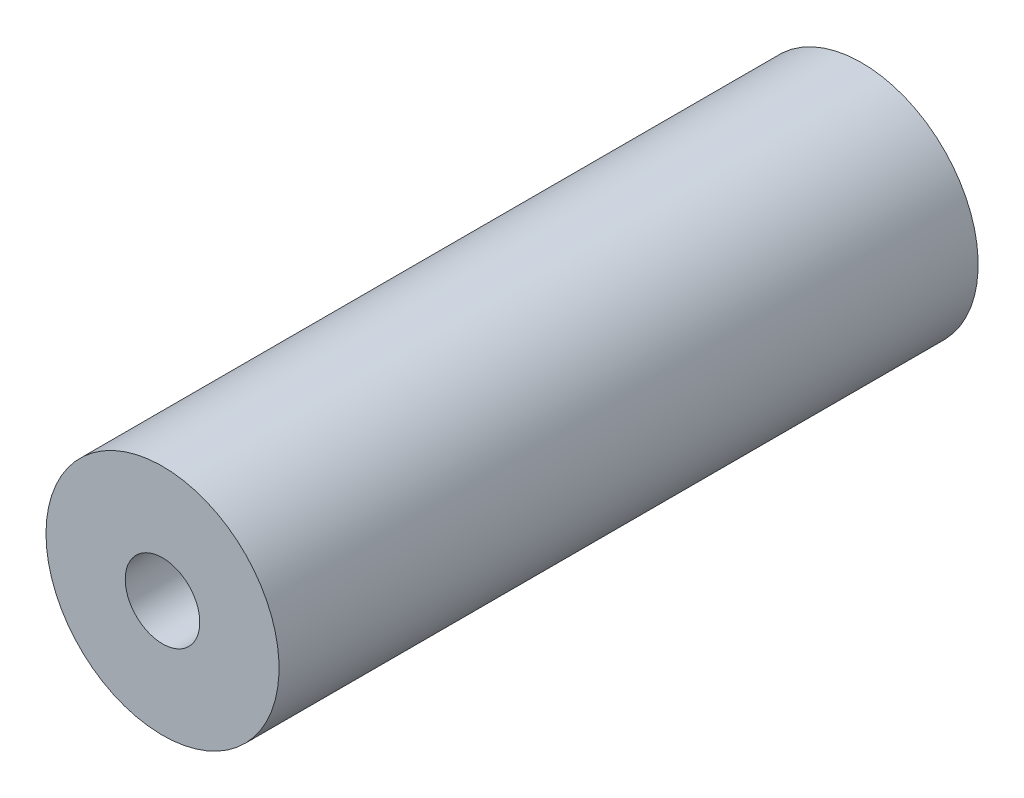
ISO-10303-21;
HEADER;
FILE_DESCRIPTION(('STEP AP214'),'2;1');
FILE_NAME('part.step','',(''),(''),'','','');
FILE_SCHEMA(('AUTOMOTIVE_DESIGN { 1 0 10303 214 1 1 1 1 }'));
ENDSEC;
DATA;
#1=APPLICATION_CONTEXT('core data for automotive mechanical design processes');
#2=APPLICATION_PROTOCOL_DEFINITION('international standard','automotive_design',2000,#1);
#3=PRODUCT_CONTEXT('',#1,'mechanical');
#4=PRODUCT('Part','Part','',(#3));
#5=PRODUCT_RELATED_PRODUCT_CATEGORY('part','',(#4));
#6=PRODUCT_DEFINITION_FORMATION('','',#4);
#7=PRODUCT_DEFINITION_CONTEXT('part definition',#1,'design');
#8=PRODUCT_DEFINITION('design','',#6,#7);
#9=PRODUCT_DEFINITION_SHAPE('','',#8);
#10=(LENGTH_UNIT() NAMED_UNIT(*) SI_UNIT(.MILLI.,.METRE.));
#11=(NAMED_UNIT(*) PLANE_ANGLE_UNIT() SI_UNIT($,.RADIAN.));
#12=(NAMED_UNIT(*) SI_UNIT($,.STERADIAN.) SOLID_ANGLE_UNIT());
#13=UNCERTAINTY_MEASURE_WITH_UNIT(LENGTH_MEASURE(1.E-05),#10,'distance_accuracy_value','');
#14=(GEOMETRIC_REPRESENTATION_CONTEXT(3) GLOBAL_UNCERTAINTY_ASSIGNED_CONTEXT((#13)) GLOBAL_UNIT_ASSIGNED_CONTEXT((#10,
#11,#12)) REPRESENTATION_CONTEXT('',''));
#15=CARTESIAN_POINT('',(0.,0.,0.));
#16=DIRECTION('',(0.,0.,1.));
#17=DIRECTION('',(1.,0.,0.));
#18=AXIS2_PLACEMENT_3D('',#15,#16,#17);
#19=CARTESIAN_POINT('',(0.,0.,19.05));
#20=DIRECTION('',(0.,0.,1.));
#21=DIRECTION('',(1.,0.,0.));
#22=AXIS2_PLACEMENT_3D('',#19,#20,#21);
#23=PLANE('',#22);
#24=CARTESIAN_POINT('',(0.,0.,19.05));
#25=DIRECTION('',(0.,0.,1.));
#26=DIRECTION('',(1.,0.,0.));
#27=AXIS2_PLACEMENT_3D('',#24,#25,#26);
#28=CIRCLE('',#27,3.175);
#29=CARTESIAN_POINT('',(-3.175,0.,19.05));
#30=VERTEX_POINT('',#29);
#31=EDGE_CURVE('E10',#30,#30,#28,.T.);
#32=ORIENTED_EDGE('',*,*,#31,.T.);
#33=EDGE_LOOP('',(#32));
#34=FACE_BOUND('',#33,.T.);
#35=CARTESIAN_POINT('',(0.,0.,19.05));
#36=DIRECTION('',(0.,0.,1.));
#37=DIRECTION('',(1.,0.,0.));
#38=AXIS2_PLACEMENT_3D('',#35,#36,#37);
#39=CIRCLE('',#38,1.016);
#40=CARTESIAN_POINT('',(-1.016,0.,19.05));
#41=VERTEX_POINT('',#40);
#42=EDGE_CURVE('E42',#41,#41,#39,.T.);
#43=ORIENTED_EDGE('',*,*,#42,.F.);
#44=EDGE_LOOP('',(#43));
#45=FACE_BOUND('',#44,.T.);
#46=ADVANCED_FACE('F31',(#34,#45),#23,.T.);
#47=CARTESIAN_POINT('',(0.,0.,0.));
#48=DIRECTION('',(0.,0.,1.));
#49=DIRECTION('',(1.,0.,0.));
#50=AXIS2_PLACEMENT_3D('',#47,#48,#49);
#51=PLANE('',#50);
#52=CARTESIAN_POINT('',(0.,0.,0.));
#53=DIRECTION('',(0.,0.,1.));
#54=DIRECTION('',(1.,0.,0.));
#55=AXIS2_PLACEMENT_3D('',#52,#53,#54);
#56=CIRCLE('',#55,3.175);
#57=CARTESIAN_POINT('',(-3.175,0.,0.));
#58=VERTEX_POINT('',#57);
#59=EDGE_CURVE('E35',#58,#58,#56,.T.);
#60=ORIENTED_EDGE('',*,*,#59,.F.);
#61=EDGE_LOOP('',(#60));
#62=FACE_BOUND('',#61,.T.);
#63=CARTESIAN_POINT('',(0.,0.,0.));
#64=DIRECTION('',(0.,0.,1.));
#65=DIRECTION('',(1.,0.,0.));
#66=AXIS2_PLACEMENT_3D('',#63,#64,#65);
#67=CIRCLE('',#66,1.016);
#68=CARTESIAN_POINT('',(-1.016,0.,0.));
#69=VERTEX_POINT('',#68);
#70=EDGE_CURVE('E44',#69,#69,#67,.T.);
#71=ORIENTED_EDGE('',*,*,#70,.T.);
#72=EDGE_LOOP('',(#71));
#73=FACE_BOUND('',#72,.T.);
#74=ADVANCED_FACE('F54',(#62,#73),#51,.F.);
#75=CARTESIAN_POINT('',(0.,0.,19.05));
#76=DIRECTION('',(0.,0.,-1.));
#77=DIRECTION('',(-1.,0.,0.));
#78=AXIS2_PLACEMENT_3D('',#75,#76,#77);
#79=CYLINDRICAL_SURFACE('',#78,3.175);
#80=CARTESIAN_POINT('',(-3.175,0.,19.05));
#81=CARTESIAN_POINT('',(-3.175,0.,18.8515625));
#82=CARTESIAN_POINT('',(-3.175,0.,18.653125));
#83=CARTESIAN_POINT('',(-3.175,0.,18.25625));
#84=CARTESIAN_POINT('',(-3.175,0.,18.0578125));
#85=CARTESIAN_POINT('',(-3.175,0.,17.6609375));
#86=CARTESIAN_POINT('',(-3.175,0.,17.4625));
#87=CARTESIAN_POINT('',(-3.175,0.,17.065625));
#88=CARTESIAN_POINT('',(-3.175,0.,16.8671875));
#89=CARTESIAN_POINT('',(-3.175,0.,16.4703125));
#90=CARTESIAN_POINT('',(-3.175,0.,16.271875));
#91=CARTESIAN_POINT('',(-3.175,0.,15.875));
#92=CARTESIAN_POINT('',(-3.175,0.,15.6765625));
#93=CARTESIAN_POINT('',(-3.175,0.,15.2796875));
#94=CARTESIAN_POINT('',(-3.175,0.,15.08125));
#95=CARTESIAN_POINT('',(-3.175,0.,14.684375));
#96=CARTESIAN_POINT('',(-3.175,0.,14.4859375));
#97=CARTESIAN_POINT('',(-3.175,0.,14.0890625));
#98=CARTESIAN_POINT('',(-3.175,0.,13.890625));
#99=CARTESIAN_POINT('',(-3.175,0.,13.49375));
#100=CARTESIAN_POINT('',(-3.175,0.,13.2953125));
#101=CARTESIAN_POINT('',(-3.175,0.,12.8984375));
#102=CARTESIAN_POINT('',(-3.175,0.,12.7));
#103=CARTESIAN_POINT('',(-3.175,0.,12.303125));
#104=CARTESIAN_POINT('',(-3.175,0.,12.1046875));
#105=CARTESIAN_POINT('',(-3.175,0.,11.7078125));
#106=CARTESIAN_POINT('',(-3.175,0.,11.509375));
#107=CARTESIAN_POINT('',(-3.175,0.,11.1125));
#108=CARTESIAN_POINT('',(-3.175,0.,10.9140625));
#109=CARTESIAN_POINT('',(-3.175,0.,10.5171875));
#110=CARTESIAN_POINT('',(-3.175,0.,10.31875));
#111=CARTESIAN_POINT('',(-3.175,0.,9.921875));
#112=CARTESIAN_POINT('',(-3.175,0.,9.7234375));
#113=CARTESIAN_POINT('',(-3.175,0.,9.3265625));
#114=CARTESIAN_POINT('',(-3.175,0.,9.128125));
#115=CARTESIAN_POINT('',(-3.175,0.,8.73125));
#116=CARTESIAN_POINT('',(-3.175,0.,8.5328125));
#117=CARTESIAN_POINT('',(-3.175,0.,8.1359375));
#118=CARTESIAN_POINT('',(-3.175,0.,7.9375));
#119=CARTESIAN_POINT('',(-3.175,0.,7.540625));
#120=CARTESIAN_POINT('',(-3.175,0.,7.3421875));
#121=CARTESIAN_POINT('',(-3.175,0.,6.9453125));
#122=CARTESIAN_POINT('',(-3.175,0.,6.746875));
#123=CARTESIAN_POINT('',(-3.175,0.,6.35));
#124=CARTESIAN_POINT('',(-3.175,0.,6.1515625));
#125=CARTESIAN_POINT('',(-3.175,0.,5.7546875));
#126=CARTESIAN_POINT('',(-3.175,0.,5.55625));
#127=CARTESIAN_POINT('',(-3.175,0.,5.159375));
#128=CARTESIAN_POINT('',(-3.175,0.,4.9609375));
#129=CARTESIAN_POINT('',(-3.175,0.,4.5640625));
#130=CARTESIAN_POINT('',(-3.175,0.,4.365625));
#131=CARTESIAN_POINT('',(-3.175,0.,3.96875));
#132=CARTESIAN_POINT('',(-3.175,0.,3.7703125));
#133=CARTESIAN_POINT('',(-3.175,0.,3.3734375));
#134=CARTESIAN_POINT('',(-3.175,0.,3.175));
#135=CARTESIAN_POINT('',(-3.175,0.,2.778125));
#136=CARTESIAN_POINT('',(-3.175,0.,2.5796875));
#137=CARTESIAN_POINT('',(-3.175,0.,2.1828125));
#138=CARTESIAN_POINT('',(-3.175,0.,1.984375));
#139=CARTESIAN_POINT('',(-3.175,0.,1.5875));
#140=CARTESIAN_POINT('',(-3.175,0.,1.3890625));
#141=CARTESIAN_POINT('',(-3.175,0.,0.992187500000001));
#142=CARTESIAN_POINT('',(-3.175,0.,0.793750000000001));
#143=CARTESIAN_POINT('',(-3.175,0.,0.396875));
#144=CARTESIAN_POINT('',(-3.175,0.,0.1984375));
#145=CARTESIAN_POINT('',(-3.175,0.,0.));
#146=B_SPLINE_CURVE_WITH_KNOTS('',3,(#80,#81,#82,#83,#84,#85,#86,#87,#88,#89,#90,#91,#92,#93,
#94,#95,#96,#97,#98,#99,#100,#101,#102,#103,#104,#105,#106,#107,#108,#109,#110,#111,#112,#113,
#114,#115,#116,#117,#118,#119,#120,#121,#122,#123,#124,#125,#126,#127,#128,#129,#130,#131,#132,
#133,#134,#135,#136,#137,#138,#139,#140,#141,#142,#143,#144,#145),.UNSPECIFIED.,.F.,.F.,(4,2,2,
2,2,2,2,2,2,2,2,2,2,2,2,2,2,2,2,2,2,2,2,2,2,2,2,2,2,2,2,2,4),(0.,0.595312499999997,1.190625,
1.7859375,2.38125,2.9765625,3.571875,4.1671875,4.7625,5.3578125,5.953125,6.5484375,7.14375,
7.7390625,8.334375,8.9296875,9.525,10.1203125,10.715625,11.3109375,11.90625,12.5015625,
13.096875,13.6921875,14.2875,14.8828125,15.478125,16.0734375,16.66875,17.2640625,17.859375,
18.4546875,19.05),.UNSPECIFIED.);
#147=EDGE_CURVE('BSEAM33',#30,#58,#146,.T.);
#148=ORIENTED_EDGE('',*,*,#31,.F.);
#149=ORIENTED_EDGE('',*,*,#59,.T.);
#150=ORIENTED_EDGE('',*,*,#147,.T.);
#151=ORIENTED_EDGE('',*,*,#147,.F.);
#152=EDGE_LOOP('',(#148,#150,#149,#151));
#153=FACE_BOUND('',#152,.T.);
#154=ADVANCED_FACE('F33',(#153),#79,.T.);
#155=CARTESIAN_POINT('',(0.,0.,19.05));
#156=DIRECTION('',(0.,0.,-1.));
#157=DIRECTION('',(-1.,0.,0.));
#158=AXIS2_PLACEMENT_3D('',#155,#156,#157);
#159=CYLINDRICAL_SURFACE('',#158,1.016);
#160=CARTESIAN_POINT('',(-1.016,0.,19.05));
#161=CARTESIAN_POINT('',(-1.016,0.,18.8515625));
#162=CARTESIAN_POINT('',(-1.016,0.,18.653125));
#163=CARTESIAN_POINT('',(-1.016,0.,18.25625));
#164=CARTESIAN_POINT('',(-1.016,0.,18.0578125));
#165=CARTESIAN_POINT('',(-1.016,0.,17.6609375));
#166=CARTESIAN_POINT('',(-1.016,0.,17.4625));
#167=CARTESIAN_POINT('',(-1.016,0.,17.065625));
#168=CARTESIAN_POINT('',(-1.016,0.,16.8671875));
#169=CARTESIAN_POINT('',(-1.016,0.,16.4703125));
#170=CARTESIAN_POINT('',(-1.016,0.,16.271875));
#171=CARTESIAN_POINT('',(-1.016,0.,15.875));
#172=CARTESIAN_POINT('',(-1.016,0.,15.6765625));
#173=CARTESIAN_POINT('',(-1.016,0.,15.2796875));
#174=CARTESIAN_POINT('',(-1.016,0.,15.08125));
#175=CARTESIAN_POINT('',(-1.016,0.,14.684375));
#176=CARTESIAN_POINT('',(-1.016,0.,14.4859375));
#177=CARTESIAN_POINT('',(-1.016,0.,14.0890625));
#178=CARTESIAN_POINT('',(-1.016,0.,13.890625));
#179=CARTESIAN_POINT('',(-1.016,0.,13.49375));
#180=CARTESIAN_POINT('',(-1.016,0.,13.2953125));
#181=CARTESIAN_POINT('',(-1.016,0.,12.8984375));
#182=CARTESIAN_POINT('',(-1.016,0.,12.7));
#183=CARTESIAN_POINT('',(-1.016,0.,12.303125));
#184=CARTESIAN_POINT('',(-1.016,0.,12.1046875));
#185=CARTESIAN_POINT('',(-1.016,0.,11.7078125));
#186=CARTESIAN_POINT('',(-1.016,0.,11.509375));
#187=CARTESIAN_POINT('',(-1.016,0.,11.1125));
#188=CARTESIAN_POINT('',(-1.016,0.,10.9140625));
#189=CARTESIAN_POINT('',(-1.016,0.,10.5171875));
#190=CARTESIAN_POINT('',(-1.016,0.,10.31875));
#191=CARTESIAN_POINT('',(-1.016,0.,9.921875));
#192=CARTESIAN_POINT('',(-1.016,0.,9.7234375));
#193=CARTESIAN_POINT('',(-1.016,0.,9.3265625));
#194=CARTESIAN_POINT('',(-1.016,0.,9.128125));
#195=CARTESIAN_POINT('',(-1.016,0.,8.73125));
#196=CARTESIAN_POINT('',(-1.016,0.,8.5328125));
#197=CARTESIAN_POINT('',(-1.016,0.,8.1359375));
#198=CARTESIAN_POINT('',(-1.016,0.,7.9375));
#199=CARTESIAN_POINT('',(-1.016,0.,7.540625));
#200=CARTESIAN_POINT('',(-1.016,0.,7.3421875));
#201=CARTESIAN_POINT('',(-1.016,0.,6.9453125));
#202=CARTESIAN_POINT('',(-1.016,0.,6.746875));
#203=CARTESIAN_POINT('',(-1.016,0.,6.35));
#204=CARTESIAN_POINT('',(-1.016,0.,6.1515625));
#205=CARTESIAN_POINT('',(-1.016,0.,5.7546875));
#206=CARTESIAN_POINT('',(-1.016,0.,5.55625));
#207=CARTESIAN_POINT('',(-1.016,0.,5.159375));
#208=CARTESIAN_POINT('',(-1.016,0.,4.9609375));
#209=CARTESIAN_POINT('',(-1.016,0.,4.5640625));
#210=CARTESIAN_POINT('',(-1.016,0.,4.365625));
#211=CARTESIAN_POINT('',(-1.016,0.,3.96875));
#212=CARTESIAN_POINT('',(-1.016,0.,3.7703125));
#213=CARTESIAN_POINT('',(-1.016,0.,3.3734375));
#214=CARTESIAN_POINT('',(-1.016,0.,3.175));
#215=CARTESIAN_POINT('',(-1.016,0.,2.778125));
#216=CARTESIAN_POINT('',(-1.016,0.,2.5796875));
#217=CARTESIAN_POINT('',(-1.016,0.,2.1828125));
#218=CARTESIAN_POINT('',(-1.016,0.,1.984375));
#219=CARTESIAN_POINT('',(-1.016,0.,1.5875));
#220=CARTESIAN_POINT('',(-1.016,0.,1.3890625));
#221=CARTESIAN_POINT('',(-1.016,0.,0.992187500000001));
#222=CARTESIAN_POINT('',(-1.016,0.,0.793750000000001));
#223=CARTESIAN_POINT('',(-1.016,0.,0.396875));
#224=CARTESIAN_POINT('',(-1.016,0.,0.1984375));
#225=CARTESIAN_POINT('',(-1.016,0.,0.));
#226=B_SPLINE_CURVE_WITH_KNOTS('',3,(#160,#161,#162,#163,#164,#165,#166,#167,#168,#169,#170,
#171,#172,#173,#174,#175,#176,#177,#178,#179,#180,#181,#182,#183,#184,#185,#186,#187,#188,#189,
#190,#191,#192,#193,#194,#195,#196,#197,#198,#199,#200,#201,#202,#203,#204,#205,#206,#207,#208,
#209,#210,#211,#212,#213,#214,#215,#216,#217,#218,#219,#220,#221,#222,#223,#224,#225),
.UNSPECIFIED.,.F.,.F.,(4,2,2,2,2,2,2,2,2,2,2,2,2,2,2,2,2,2,2,2,2,2,2,2,2,2,2,2,2,2,2,2,4),(0.,
0.5953125,1.190625,1.7859375,2.38125,2.9765625,3.571875,4.1671875,4.7625,5.3578125,5.953125,
6.5484375,7.14375,7.7390625,8.334375,8.9296875,9.525,10.1203125,10.715625,11.3109375,11.90625,
12.5015625,13.096875,13.6921875,14.2875,14.8828125,15.478125,16.0734375,16.66875,17.2640625,
17.859375,18.4546875,19.05),.UNSPECIFIED.);
#227=EDGE_CURVE('BSEAM50',#41,#69,#226,.T.);
#228=ORIENTED_EDGE('',*,*,#42,.T.);
#229=ORIENTED_EDGE('',*,*,#70,.F.);
#230=ORIENTED_EDGE('',*,*,#227,.T.);
#231=ORIENTED_EDGE('',*,*,#227,.F.);
#232=EDGE_LOOP('',(#228,#230,#229,#231));
#233=FACE_BOUND('',#232,.T.);
#234=ADVANCED_FACE('F50',(#233),#159,.F.);
#235=CLOSED_SHELL('',(#46,#74,#154,#234));
#236=MANIFOLD_SOLID_BREP('B2',#235);
#237=ADVANCED_BREP_SHAPE_REPRESENTATION('',(#18,#236),#14);
#238=SHAPE_DEFINITION_REPRESENTATION(#9,#237);
ENDSEC;
END-ISO-10303-21;
